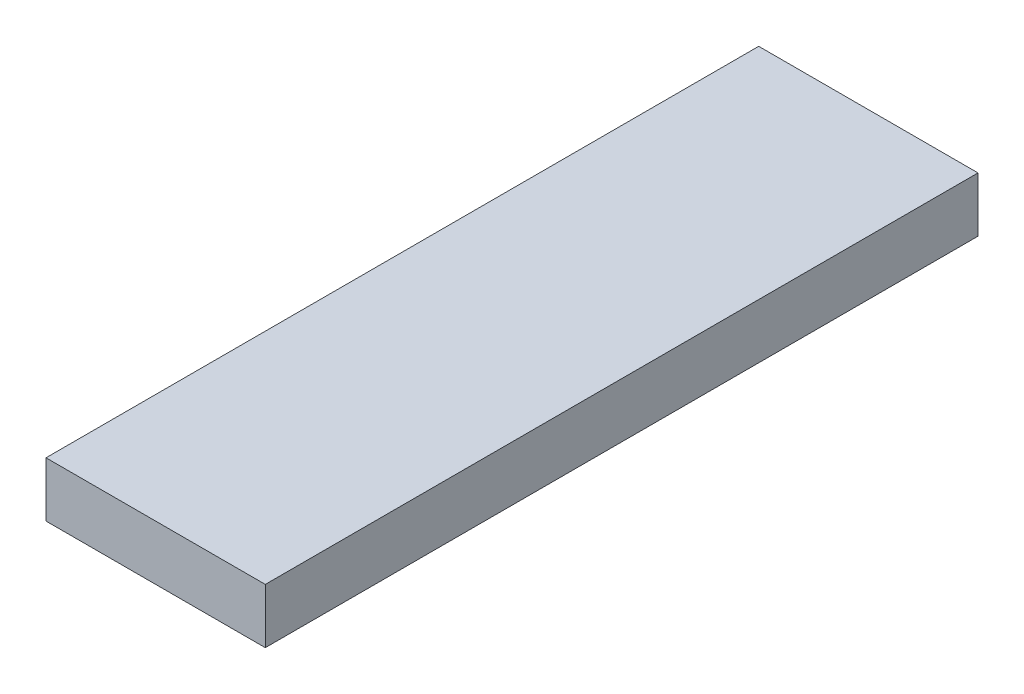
ISO-10303-21;
HEADER;
FILE_DESCRIPTION(('STEP AP214'),'2;1');
FILE_NAME('part.step','',(''),(''),'','','');
FILE_SCHEMA(('AUTOMOTIVE_DESIGN { 1 0 10303 214 1 1 1 1 }'));
ENDSEC;
DATA;
#1=APPLICATION_CONTEXT('core data for automotive mechanical design processes');
#2=APPLICATION_PROTOCOL_DEFINITION('international standard','automotive_design',2000,#1);
#3=PRODUCT_CONTEXT('',#1,'mechanical');
#4=PRODUCT('Part','Part','',(#3));
#5=PRODUCT_RELATED_PRODUCT_CATEGORY('part','',(#4));
#6=PRODUCT_DEFINITION_FORMATION('','',#4);
#7=PRODUCT_DEFINITION_CONTEXT('part definition',#1,'design');
#8=PRODUCT_DEFINITION('design','',#6,#7);
#9=PRODUCT_DEFINITION_SHAPE('','',#8);
#10=(LENGTH_UNIT() NAMED_UNIT(*) SI_UNIT(.MILLI.,.METRE.));
#11=(NAMED_UNIT(*) PLANE_ANGLE_UNIT() SI_UNIT($,.RADIAN.));
#12=(NAMED_UNIT(*) SI_UNIT($,.STERADIAN.) SOLID_ANGLE_UNIT());
#13=UNCERTAINTY_MEASURE_WITH_UNIT(LENGTH_MEASURE(1.E-05),#10,'distance_accuracy_value','');
#14=(GEOMETRIC_REPRESENTATION_CONTEXT(3) GLOBAL_UNCERTAINTY_ASSIGNED_CONTEXT((#13)) GLOBAL_UNIT_ASSIGNED_CONTEXT((#10,
#11,#12)) REPRESENTATION_CONTEXT('',''));
#15=CARTESIAN_POINT('',(0.,0.,0.));
#16=DIRECTION('',(0.,0.,1.));
#17=DIRECTION('',(1.,0.,0.));
#18=AXIS2_PLACEMENT_3D('',#15,#16,#17);
#19=CARTESIAN_POINT('',(25.4,-6.35,165.1));
#20=DIRECTION('',(-1.,0.,0.));
#21=DIRECTION('',(0.,0.,1.));
#22=AXIS2_PLACEMENT_3D('',#19,#20,#21);
#23=PLANE('',#22);
#24=DIRECTION('',(0.,1.,0.));
#25=VECTOR('',#24,1.);
#26=CARTESIAN_POINT('',(25.4,-6.35,0.));
#27=LINE('',#26,#25);
#28=CARTESIAN_POINT('',(25.4,-6.35,0.));
#29=VERTEX_POINT('',#28);
#30=CARTESIAN_POINT('',(25.4,6.35,0.));
#31=VERTEX_POINT('',#30);
#32=EDGE_CURVE('E113',#29,#31,#27,.T.);
#33=ORIENTED_EDGE('',*,*,#32,.T.);
#34=DIRECTION('',(0.,0.,-1.));
#35=VECTOR('',#34,1.);
#36=CARTESIAN_POINT('',(25.4,6.35,165.1));
#37=LINE('',#36,#35);
#38=CARTESIAN_POINT('',(25.4,6.35,165.1));
#39=VERTEX_POINT('',#38);
#40=EDGE_CURVE('E11',#39,#31,#37,.T.);
#41=ORIENTED_EDGE('',*,*,#40,.F.);
#42=DIRECTION('',(0.,1.,0.));
#43=VECTOR('',#42,1.);
#44=CARTESIAN_POINT('',(25.4,-6.35,165.1));
#45=LINE('',#44,#43);
#46=CARTESIAN_POINT('',(25.4,-6.35,165.1));
#47=VERTEX_POINT('',#46);
#48=EDGE_CURVE('E97',#47,#39,#45,.T.);
#49=ORIENTED_EDGE('',*,*,#48,.F.);
#50=DIRECTION('',(0.,0.,-1.));
#51=VECTOR('',#50,1.);
#52=CARTESIAN_POINT('',(25.4,-6.35,165.1));
#53=LINE('',#52,#51);
#54=EDGE_CURVE('E109',#47,#29,#53,.T.);
#55=ORIENTED_EDGE('',*,*,#54,.T.);
#56=EDGE_LOOP('',(#33,#41,#49,#55));
#57=FACE_BOUND('',#56,.T.);
#58=ADVANCED_FACE('F45',(#57),#23,.F.);
#59=CARTESIAN_POINT('',(-25.4,6.35,165.1));
#60=DIRECTION('',(0.,-1.,0.));
#61=DIRECTION('',(0.,0.,-1.));
#62=AXIS2_PLACEMENT_3D('',#59,#60,#61);
#63=PLANE('',#62);
#64=DIRECTION('',(-1.,0.,0.));
#65=VECTOR('',#64,1.);
#66=CARTESIAN_POINT('',(-25.4,6.35,0.));
#67=LINE('',#66,#65);
#68=CARTESIAN_POINT('',(-25.4,6.35,0.));
#69=VERTEX_POINT('',#68);
#70=EDGE_CURVE('E102',#31,#69,#67,.T.);
#71=ORIENTED_EDGE('',*,*,#70,.T.);
#72=DIRECTION('',(0.,0.,-1.));
#73=VECTOR('',#72,1.);
#74=CARTESIAN_POINT('',(-25.4,6.35,165.1));
#75=LINE('',#74,#73);
#76=CARTESIAN_POINT('',(-25.4,6.35,165.1));
#77=VERTEX_POINT('',#76);
#78=EDGE_CURVE('E54',#77,#69,#75,.T.);
#79=ORIENTED_EDGE('',*,*,#78,.F.);
#80=DIRECTION('',(-1.,0.,0.));
#81=VECTOR('',#80,1.);
#82=CARTESIAN_POINT('',(-25.4,6.35,165.1));
#83=LINE('',#82,#81);
#84=EDGE_CURVE('E92',#39,#77,#83,.T.);
#85=ORIENTED_EDGE('',*,*,#84,.F.);
#86=ORIENTED_EDGE('',*,*,#40,.T.);
#87=EDGE_LOOP('',(#71,#79,#85,#86));
#88=FACE_BOUND('',#87,.T.);
#89=ADVANCED_FACE('F101',(#88),#63,.F.);
#90=CARTESIAN_POINT('',(-25.4,-6.35,165.1));
#91=DIRECTION('',(1.,0.,0.));
#92=DIRECTION('',(0.,0.,-1.));
#93=AXIS2_PLACEMENT_3D('',#90,#91,#92);
#94=PLANE('',#93);
#95=DIRECTION('',(0.,-1.,0.));
#96=VECTOR('',#95,1.);
#97=CARTESIAN_POINT('',(-25.4,-6.35,0.));
#98=LINE('',#97,#96);
#99=CARTESIAN_POINT('',(-25.4,-6.35,0.));
#100=VERTEX_POINT('',#99);
#101=EDGE_CURVE('E79',#69,#100,#98,.T.);
#102=ORIENTED_EDGE('',*,*,#101,.T.);
#103=DIRECTION('',(0.,0.,-1.));
#104=VECTOR('',#103,1.);
#105=CARTESIAN_POINT('',(-25.4,-6.35,165.1));
#106=LINE('',#105,#104);
#107=CARTESIAN_POINT('',(-25.4,-6.35,165.1));
#108=VERTEX_POINT('',#107);
#109=EDGE_CURVE('E104',#108,#100,#106,.T.);
#110=ORIENTED_EDGE('',*,*,#109,.F.);
#111=DIRECTION('',(0.,-1.,0.));
#112=VECTOR('',#111,1.);
#113=CARTESIAN_POINT('',(-25.4,-6.35,165.1));
#114=LINE('',#113,#112);
#115=EDGE_CURVE('E95',#77,#108,#114,.T.);
#116=ORIENTED_EDGE('',*,*,#115,.F.);
#117=ORIENTED_EDGE('',*,*,#78,.T.);
#118=EDGE_LOOP('',(#102,#110,#116,#117));
#119=FACE_BOUND('',#118,.T.);
#120=ADVANCED_FACE('F105',(#119),#94,.F.);
#121=CARTESIAN_POINT('',(-25.4,-6.35,165.1));
#122=DIRECTION('',(0.,1.,0.));
#123=DIRECTION('',(0.,0.,1.));
#124=AXIS2_PLACEMENT_3D('',#121,#122,#123);
#125=PLANE('',#124);
#126=DIRECTION('',(1.,0.,0.));
#127=VECTOR('',#126,1.);
#128=CARTESIAN_POINT('',(-25.4,-6.35,0.));
#129=LINE('',#128,#127);
#130=EDGE_CURVE('E85',#100,#29,#129,.T.);
#131=ORIENTED_EDGE('',*,*,#130,.T.);
#132=ORIENTED_EDGE('',*,*,#54,.F.);
#133=DIRECTION('',(1.,0.,0.));
#134=VECTOR('',#133,1.);
#135=CARTESIAN_POINT('',(-25.4,-6.35,165.1));
#136=LINE('',#135,#134);
#137=EDGE_CURVE('E62',#108,#47,#136,.T.);
#138=ORIENTED_EDGE('',*,*,#137,.F.);
#139=ORIENTED_EDGE('',*,*,#109,.T.);
#140=EDGE_LOOP('',(#131,#132,#138,#139));
#141=FACE_BOUND('',#140,.T.);
#142=ADVANCED_FACE('F126',(#141),#125,.F.);
#143=CARTESIAN_POINT('',(0.,0.,165.1));
#144=DIRECTION('',(0.,0.,-1.));
#145=DIRECTION('',(-1.,0.,0.));
#146=AXIS2_PLACEMENT_3D('',#143,#144,#145);
#147=PLANE('',#146);
#148=ORIENTED_EDGE('',*,*,#48,.T.);
#149=ORIENTED_EDGE('',*,*,#84,.T.);
#150=ORIENTED_EDGE('',*,*,#115,.T.);
#151=ORIENTED_EDGE('',*,*,#137,.T.);
#152=EDGE_LOOP('',(#148,#149,#150,#151));
#153=FACE_BOUND('',#152,.T.);
#154=ADVANCED_FACE('F93',(#153),#147,.F.);
#155=CARTESIAN_POINT('',(0.,0.,0.));
#156=DIRECTION('',(0.,0.,-1.));
#157=DIRECTION('',(-1.,0.,0.));
#158=AXIS2_PLACEMENT_3D('',#155,#156,#157);
#159=PLANE('',#158);
#160=ORIENTED_EDGE('',*,*,#32,.F.);
#161=ORIENTED_EDGE('',*,*,#130,.F.);
#162=ORIENTED_EDGE('',*,*,#101,.F.);
#163=ORIENTED_EDGE('',*,*,#70,.F.);
#164=EDGE_LOOP('',(#160,#161,#162,#163));
#165=FACE_BOUND('',#164,.T.);
#166=ADVANCED_FACE('F129',(#165),#159,.T.);
#167=CLOSED_SHELL('',(#58,#89,#120,#142,#154,#166));
#168=MANIFOLD_SOLID_BREP('B2',#167);
#169=ADVANCED_BREP_SHAPE_REPRESENTATION('',(#18,#168),#14);
#170=SHAPE_DEFINITION_REPRESENTATION(#9,#169);
ENDSEC;
END-ISO-10303-21;
